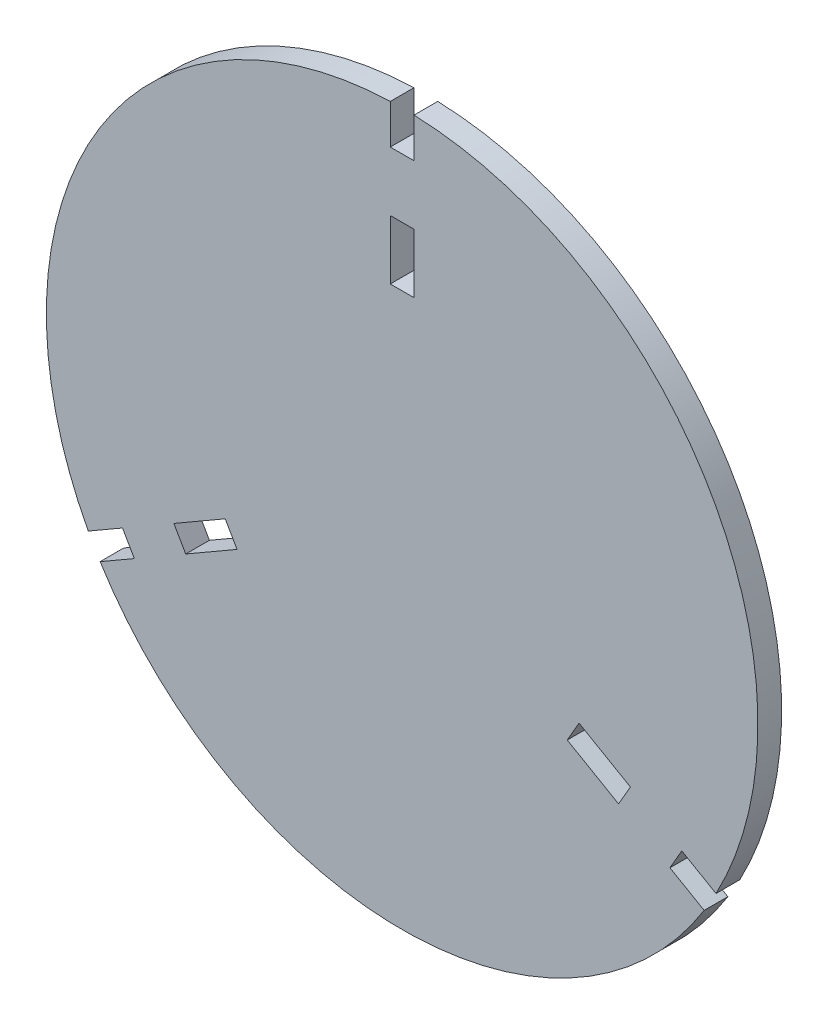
ISO-10303-21;
HEADER;
FILE_DESCRIPTION(('STEP AP214'),'2;1');
FILE_NAME('part.step','',(''),(''),'','','');
FILE_SCHEMA(('AUTOMOTIVE_DESIGN { 1 0 10303 214 1 1 1 1 }'));
ENDSEC;
DATA;
#1=APPLICATION_CONTEXT('core data for automotive mechanical design processes');
#2=APPLICATION_PROTOCOL_DEFINITION('international standard','automotive_design',2000,#1);
#3=PRODUCT_CONTEXT('',#1,'mechanical');
#4=PRODUCT('Part','Part','',(#3));
#5=PRODUCT_RELATED_PRODUCT_CATEGORY('part','',(#4));
#6=PRODUCT_DEFINITION_FORMATION('','',#4);
#7=PRODUCT_DEFINITION_CONTEXT('part definition',#1,'design');
#8=PRODUCT_DEFINITION('design','',#6,#7);
#9=PRODUCT_DEFINITION_SHAPE('','',#8);
#10=(LENGTH_UNIT() NAMED_UNIT(*) SI_UNIT(.MILLI.,.METRE.));
#11=(NAMED_UNIT(*) PLANE_ANGLE_UNIT() SI_UNIT($,.RADIAN.));
#12=(NAMED_UNIT(*) SI_UNIT($,.STERADIAN.) SOLID_ANGLE_UNIT());
#13=UNCERTAINTY_MEASURE_WITH_UNIT(LENGTH_MEASURE(1.E-05),#10,'distance_accuracy_value','');
#14=(GEOMETRIC_REPRESENTATION_CONTEXT(3) GLOBAL_UNCERTAINTY_ASSIGNED_CONTEXT((#13)) GLOBAL_UNIT_ASSIGNED_CONTEXT((#10,
#11,#12)) REPRESENTATION_CONTEXT('',''));
#15=CARTESIAN_POINT('',(0.,0.,0.));
#16=DIRECTION('',(0.,0.,1.));
#17=DIRECTION('',(1.,0.,0.));
#18=AXIS2_PLACEMENT_3D('',#15,#16,#17);
#19=CARTESIAN_POINT('',(0.,0.,12.));
#20=DIRECTION('',(0.,0.,1.));
#21=DIRECTION('',(1.,0.,0.));
#22=AXIS2_PLACEMENT_3D('',#19,#20,#21);
#23=PLANE('',#22);
#24=CARTESIAN_POINT('',(0.,0.,12.));
#25=DIRECTION('',(0.,0.,1.));
#26=DIRECTION('',(1.,0.,0.));
#27=AXIS2_PLACEMENT_3D('',#24,#25,#26);
#28=CIRCLE('',#27,180.);
#29=CARTESIAN_POINT('',(-6.,179.899972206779,12.));
#30=VERTEX_POINT('',#29);
#31=CARTESIAN_POINT('',(-158.797946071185,-84.7538336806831,12.));
#32=VERTEX_POINT('',#31);
#33=EDGE_CURVE('E341',#30,#32,#28,.T.);
#34=ORIENTED_EDGE('',*,*,#33,.T.);
#35=DIRECTION('',(0.866025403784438,0.500000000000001,0.));
#36=VECTOR('',#35,1.);
#37=CARTESIAN_POINT('',(-158.797946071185,-84.7538336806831,12.));
#38=LINE('',#37,#36);
#39=CARTESIAN_POINT('',(-141.477437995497,-74.7538336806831,12.));
#40=VERTEX_POINT('',#39);
#41=EDGE_CURVE('E345',#32,#40,#38,.T.);
#42=ORIENTED_EDGE('',*,*,#41,.T.);
#43=DIRECTION('',(0.500000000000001,-0.866025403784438,0.));
#44=VECTOR('',#43,1.);
#45=CARTESIAN_POINT('',(-135.477437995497,-85.1461385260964,12.));
#46=LINE('',#45,#44);
#47=CARTESIAN_POINT('',(-135.477437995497,-85.1461385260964,12.));
#48=VERTEX_POINT('',#47);
#49=EDGE_CURVE('E349',#40,#48,#46,.T.);
#50=ORIENTED_EDGE('',*,*,#49,.T.);
#51=DIRECTION('',(-0.866025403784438,-0.500000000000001,0.));
#52=VECTOR('',#51,1.);
#53=CARTESIAN_POINT('',(-152.797946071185,-95.1461385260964,12.));
#54=LINE('',#53,#52);
#55=CARTESIAN_POINT('',(-152.797946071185,-95.1461385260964,12.));
#56=VERTEX_POINT('',#55);
#57=EDGE_CURVE('E352',#48,#56,#54,.T.);
#58=ORIENTED_EDGE('',*,*,#57,.T.);
#59=CARTESIAN_POINT('',(0.,0.,12.));
#60=DIRECTION('',(0.,0.,1.));
#61=DIRECTION('',(1.,0.,0.));
#62=AXIS2_PLACEMENT_3D('',#59,#60,#61);
#63=CIRCLE('',#62,180.);
#64=CARTESIAN_POINT('',(152.797946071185,-95.1461385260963,12.));
#65=VERTEX_POINT('',#64);
#66=EDGE_CURVE('E355',#56,#65,#63,.T.);
#67=ORIENTED_EDGE('',*,*,#66,.T.);
#68=DIRECTION('',(-0.866025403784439,0.5,0.));
#69=VECTOR('',#68,1.);
#70=CARTESIAN_POINT('',(152.797946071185,-95.1461385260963,12.));
#71=LINE('',#70,#69);
#72=CARTESIAN_POINT('',(135.477437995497,-85.1461385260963,12.));
#73=VERTEX_POINT('',#72);
#74=EDGE_CURVE('E358',#65,#73,#71,.T.);
#75=ORIENTED_EDGE('',*,*,#74,.T.);
#76=DIRECTION('',(0.500000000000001,0.866025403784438,0.));
#77=VECTOR('',#76,1.);
#78=CARTESIAN_POINT('',(141.477437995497,-74.753833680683,12.));
#79=LINE('',#78,#77);
#80=CARTESIAN_POINT('',(141.477437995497,-74.753833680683,12.));
#81=VERTEX_POINT('',#80);
#82=EDGE_CURVE('E361',#73,#81,#79,.T.);
#83=ORIENTED_EDGE('',*,*,#82,.T.);
#84=DIRECTION('',(0.866025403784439,-0.5,0.));
#85=VECTOR('',#84,1.);
#86=CARTESIAN_POINT('',(158.797946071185,-84.753833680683,12.));
#87=LINE('',#86,#85);
#88=CARTESIAN_POINT('',(158.797946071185,-84.7538336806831,12.));
#89=VERTEX_POINT('',#88);
#90=EDGE_CURVE('E364',#81,#89,#87,.T.);
#91=ORIENTED_EDGE('',*,*,#90,.T.);
#92=CARTESIAN_POINT('',(0.,0.,12.));
#93=DIRECTION('',(0.,0.,1.));
#94=DIRECTION('',(1.,0.,0.));
#95=AXIS2_PLACEMENT_3D('',#92,#93,#94);
#96=CIRCLE('',#95,180.);
#97=CARTESIAN_POINT('',(6.,179.899972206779,12.));
#98=VERTEX_POINT('',#97);
#99=EDGE_CURVE('E367',#89,#98,#96,.T.);
#100=ORIENTED_EDGE('',*,*,#99,.T.);
#101=DIRECTION('',(0.,-1.,0.));
#102=VECTOR('',#101,1.);
#103=CARTESIAN_POINT('',(6.,179.899972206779,12.));
#104=LINE('',#103,#102);
#105=CARTESIAN_POINT('',(6.,159.899972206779,12.));
#106=VERTEX_POINT('',#105);
#107=EDGE_CURVE('E370',#98,#106,#104,.T.);
#108=ORIENTED_EDGE('',*,*,#107,.T.);
#109=DIRECTION('',(-1.,0.,0.));
#110=VECTOR('',#109,1.);
#111=CARTESIAN_POINT('',(-6.,159.899972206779,12.));
#112=LINE('',#111,#110);
#113=CARTESIAN_POINT('',(-6.,159.899972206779,12.));
#114=VERTEX_POINT('',#113);
#115=EDGE_CURVE('E373',#106,#114,#112,.T.);
#116=ORIENTED_EDGE('',*,*,#115,.T.);
#117=DIRECTION('',(0.,1.,0.));
#118=VECTOR('',#117,1.);
#119=CARTESIAN_POINT('',(-6.,179.899972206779,12.));
#120=LINE('',#119,#118);
#121=EDGE_CURVE('E376',#114,#30,#120,.T.);
#122=ORIENTED_EDGE('',*,*,#121,.T.);
#123=EDGE_LOOP('',(#34,#42,#50,#58,#67,#75,#83,#91,#100,#108,#116,#122));
#124=FACE_BOUND('',#123,.T.);
#125=DIRECTION('',(1.,0.,0.));
#126=VECTOR('',#125,1.);
#127=CARTESIAN_POINT('',(-6.,99.8999722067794,12.));
#128=LINE('',#127,#126);
#129=CARTESIAN_POINT('',(-6.,99.8999722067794,12.));
#130=VERTEX_POINT('',#129);
#131=CARTESIAN_POINT('',(6.,99.8999722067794,12.));
#132=VERTEX_POINT('',#131);
#133=EDGE_CURVE('E301',#130,#132,#128,.T.);
#134=ORIENTED_EDGE('',*,*,#133,.F.);
#135=DIRECTION('',(0.,-1.,0.));
#136=VECTOR('',#135,1.);
#137=CARTESIAN_POINT('',(-6.,129.899972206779,12.));
#138=LINE('',#137,#136);
#139=CARTESIAN_POINT('',(-6.,129.899972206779,12.));
#140=VERTEX_POINT('',#139);
#141=EDGE_CURVE('E298',#140,#130,#138,.T.);
#142=ORIENTED_EDGE('',*,*,#141,.F.);
#143=DIRECTION('',(-1.,0.,0.));
#144=VECTOR('',#143,1.);
#145=CARTESIAN_POINT('',(-6.,129.899972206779,12.));
#146=LINE('',#145,#144);
#147=CARTESIAN_POINT('',(6.,129.899972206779,12.));
#148=VERTEX_POINT('',#147);
#149=EDGE_CURVE('E309',#148,#140,#146,.T.);
#150=ORIENTED_EDGE('',*,*,#149,.F.);
#151=DIRECTION('',(0.,1.,0.));
#152=VECTOR('',#151,1.);
#153=CARTESIAN_POINT('',(6.,129.899972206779,12.));
#154=LINE('',#153,#152);
#155=EDGE_CURVE('E305',#132,#148,#154,.T.);
#156=ORIENTED_EDGE('',*,*,#155,.F.);
#157=EDGE_LOOP('',(#134,#142,#150,#156));
#158=FACE_BOUND('',#157,.T.);
#159=DIRECTION('',(-0.5,-0.866025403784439,0.));
#160=VECTOR('',#159,1.);
#161=CARTESIAN_POINT('',(89.5159137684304,-44.753833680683,12.));
#162=LINE('',#161,#160);
#163=CARTESIAN_POINT('',(89.5159137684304,-44.753833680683,12.));
#164=VERTEX_POINT('',#163);
#165=CARTESIAN_POINT('',(83.5159137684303,-55.1461385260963,12.));
#166=VERTEX_POINT('',#165);
#167=EDGE_CURVE('E258',#164,#166,#162,.T.);
#168=ORIENTED_EDGE('',*,*,#167,.F.);
#169=DIRECTION('',(-0.866025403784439,0.5,0.));
#170=VECTOR('',#169,1.);
#171=CARTESIAN_POINT('',(115.496675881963,-59.753833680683,12.));
#172=LINE('',#171,#170);
#173=CARTESIAN_POINT('',(115.496675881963,-59.753833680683,12.));
#174=VERTEX_POINT('',#173);
#175=EDGE_CURVE('E255',#174,#164,#172,.T.);
#176=ORIENTED_EDGE('',*,*,#175,.F.);
#177=DIRECTION('',(0.499999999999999,0.866025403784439,0.));
#178=VECTOR('',#177,1.);
#179=CARTESIAN_POINT('',(115.496675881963,-59.753833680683,12.));
#180=LINE('',#179,#178);
#181=CARTESIAN_POINT('',(109.496675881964,-70.1461385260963,12.));
#182=VERTEX_POINT('',#181);
#183=EDGE_CURVE('E266',#182,#174,#180,.T.);
#184=ORIENTED_EDGE('',*,*,#183,.F.);
#185=DIRECTION('',(0.866025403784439,-0.499999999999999,0.));
#186=VECTOR('',#185,1.);
#187=CARTESIAN_POINT('',(109.496675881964,-70.1461385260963,12.));
#188=LINE('',#187,#186);
#189=EDGE_CURVE('E262',#166,#182,#188,.T.);
#190=ORIENTED_EDGE('',*,*,#189,.F.);
#191=EDGE_LOOP('',(#168,#176,#184,#190));
#192=FACE_BOUND('',#191,.T.);
#193=DIRECTION('',(-0.5,0.866025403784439,0.));
#194=VECTOR('',#193,1.);
#195=CARTESIAN_POINT('',(-83.5159137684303,-55.1461385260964,12.));
#196=LINE('',#195,#194);
#197=CARTESIAN_POINT('',(-83.5159137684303,-55.1461385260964,12.));
#198=VERTEX_POINT('',#197);
#199=CARTESIAN_POINT('',(-89.5159137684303,-44.7538336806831,12.));
#200=VERTEX_POINT('',#199);
#201=EDGE_CURVE('E216',#198,#200,#196,.T.);
#202=ORIENTED_EDGE('',*,*,#201,.F.);
#203=DIRECTION('',(0.866025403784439,0.5,0.));
#204=VECTOR('',#203,1.);
#205=CARTESIAN_POINT('',(-109.496675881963,-70.1461385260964,12.));
#206=LINE('',#205,#204);
#207=CARTESIAN_POINT('',(-109.496675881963,-70.1461385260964,12.));
#208=VERTEX_POINT('',#207);
#209=EDGE_CURVE('E207',#208,#198,#206,.T.);
#210=ORIENTED_EDGE('',*,*,#209,.F.);
#211=DIRECTION('',(0.500000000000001,-0.866025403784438,0.));
#212=VECTOR('',#211,1.);
#213=CARTESIAN_POINT('',(-109.496675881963,-70.1461385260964,12.));
#214=LINE('',#213,#212);
#215=CARTESIAN_POINT('',(-115.496675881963,-59.7538336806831,12.));
#216=VERTEX_POINT('',#215);
#217=EDGE_CURVE('E233',#216,#208,#214,.T.);
#218=ORIENTED_EDGE('',*,*,#217,.F.);
#219=DIRECTION('',(-0.866025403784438,-0.5,0.));
#220=VECTOR('',#219,1.);
#221=CARTESIAN_POINT('',(-115.496675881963,-59.7538336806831,12.));
#222=LINE('',#221,#220);
#223=EDGE_CURVE('E229',#200,#216,#222,.T.);
#224=ORIENTED_EDGE('',*,*,#223,.F.);
#225=EDGE_LOOP('',(#202,#210,#218,#224));
#226=FACE_BOUND('',#225,.T.);
#227=ADVANCED_FACE('F45',(#124,#158,#192,#226),#23,.T.);
#228=CARTESIAN_POINT('',(0.,0.,0.));
#229=DIRECTION('',(0.,0.,1.));
#230=DIRECTION('',(1.,0.,0.));
#231=AXIS2_PLACEMENT_3D('',#228,#229,#230);
#232=PLANE('',#231);
#233=DIRECTION('',(-0.866025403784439,0.5,0.));
#234=VECTOR('',#233,1.);
#235=CARTESIAN_POINT('',(115.496675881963,-59.753833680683,0.));
#236=LINE('',#235,#234);
#237=CARTESIAN_POINT('',(115.496675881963,-59.753833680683,0.));
#238=VERTEX_POINT('',#237);
#239=CARTESIAN_POINT('',(89.5159137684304,-44.753833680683,0.));
#240=VERTEX_POINT('',#239);
#241=EDGE_CURVE('E225',#238,#240,#236,.T.);
#242=ORIENTED_EDGE('',*,*,#241,.T.);
#243=DIRECTION('',(-0.5,-0.866025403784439,0.));
#244=VECTOR('',#243,1.);
#245=CARTESIAN_POINT('',(89.5159137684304,-44.753833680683,0.));
#246=LINE('',#245,#244);
#247=CARTESIAN_POINT('',(83.5159137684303,-55.1461385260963,0.));
#248=VERTEX_POINT('',#247);
#249=EDGE_CURVE('E273',#240,#248,#246,.T.);
#250=ORIENTED_EDGE('',*,*,#249,.T.);
#251=DIRECTION('',(0.866025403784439,-0.499999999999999,0.));
#252=VECTOR('',#251,1.);
#253=CARTESIAN_POINT('',(109.496675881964,-70.1461385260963,0.));
#254=LINE('',#253,#252);
#255=CARTESIAN_POINT('',(109.496675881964,-70.1461385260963,0.));
#256=VERTEX_POINT('',#255);
#257=EDGE_CURVE('E277',#248,#256,#254,.T.);
#258=ORIENTED_EDGE('',*,*,#257,.T.);
#259=DIRECTION('',(0.499999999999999,0.866025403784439,0.));
#260=VECTOR('',#259,1.);
#261=CARTESIAN_POINT('',(115.496675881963,-59.753833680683,0.));
#262=LINE('',#261,#260);
#263=EDGE_CURVE('E259',#256,#238,#262,.T.);
#264=ORIENTED_EDGE('',*,*,#263,.T.);
#265=EDGE_LOOP('',(#242,#250,#258,#264));
#266=FACE_BOUND('',#265,.T.);
#267=CARTESIAN_POINT('',(0.,0.,0.));
#268=DIRECTION('',(0.,0.,1.));
#269=DIRECTION('',(1.,0.,0.));
#270=AXIS2_PLACEMENT_3D('',#267,#268,#269);
#271=CIRCLE('',#270,180.);
#272=CARTESIAN_POINT('',(-6.,179.899972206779,0.));
#273=VERTEX_POINT('',#272);
#274=CARTESIAN_POINT('',(-158.797946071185,-84.7538336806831,0.));
#275=VERTEX_POINT('',#274);
#276=EDGE_CURVE('E340',#273,#275,#271,.T.);
#277=ORIENTED_EDGE('',*,*,#276,.F.);
#278=DIRECTION('',(0.,1.,0.));
#279=VECTOR('',#278,1.);
#280=CARTESIAN_POINT('',(-6.,179.899972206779,0.));
#281=LINE('',#280,#279);
#282=CARTESIAN_POINT('',(-6.,159.899972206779,0.));
#283=VERTEX_POINT('',#282);
#284=EDGE_CURVE('E346',#283,#273,#281,.T.);
#285=ORIENTED_EDGE('',*,*,#284,.F.);
#286=DIRECTION('',(-1.,0.,0.));
#287=VECTOR('',#286,1.);
#288=CARTESIAN_POINT('',(-6.,159.899972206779,0.));
#289=LINE('',#288,#287);
#290=CARTESIAN_POINT('',(6.,159.899972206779,0.));
#291=VERTEX_POINT('',#290);
#292=EDGE_CURVE('E410',#291,#283,#289,.T.);
#293=ORIENTED_EDGE('',*,*,#292,.F.);
#294=DIRECTION('',(0.,-1.,0.));
#295=VECTOR('',#294,1.);
#296=CARTESIAN_POINT('',(6.,179.899972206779,0.));
#297=LINE('',#296,#295);
#298=CARTESIAN_POINT('',(6.,179.899972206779,0.));
#299=VERTEX_POINT('',#298);
#300=EDGE_CURVE('E407',#299,#291,#297,.T.);
#301=ORIENTED_EDGE('',*,*,#300,.F.);
#302=CARTESIAN_POINT('',(0.,0.,0.));
#303=DIRECTION('',(0.,0.,1.));
#304=DIRECTION('',(1.,0.,0.));
#305=AXIS2_PLACEMENT_3D('',#302,#303,#304);
#306=CIRCLE('',#305,180.);
#307=CARTESIAN_POINT('',(158.797946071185,-84.7538336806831,0.));
#308=VERTEX_POINT('',#307);
#309=EDGE_CURVE('E404',#308,#299,#306,.T.);
#310=ORIENTED_EDGE('',*,*,#309,.F.);
#311=DIRECTION('',(0.866025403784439,-0.5,0.));
#312=VECTOR('',#311,1.);
#313=CARTESIAN_POINT('',(158.797946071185,-84.753833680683,0.));
#314=LINE('',#313,#312);
#315=CARTESIAN_POINT('',(141.477437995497,-74.753833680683,0.));
#316=VERTEX_POINT('',#315);
#317=EDGE_CURVE('E401',#316,#308,#314,.T.);
#318=ORIENTED_EDGE('',*,*,#317,.F.);
#319=DIRECTION('',(0.500000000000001,0.866025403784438,0.));
#320=VECTOR('',#319,1.);
#321=CARTESIAN_POINT('',(141.477437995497,-74.753833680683,0.));
#322=LINE('',#321,#320);
#323=CARTESIAN_POINT('',(135.477437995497,-85.1461385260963,0.));
#324=VERTEX_POINT('',#323);
#325=EDGE_CURVE('E398',#324,#316,#322,.T.);
#326=ORIENTED_EDGE('',*,*,#325,.F.);
#327=DIRECTION('',(-0.866025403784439,0.5,0.));
#328=VECTOR('',#327,1.);
#329=CARTESIAN_POINT('',(152.797946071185,-95.1461385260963,0.));
#330=LINE('',#329,#328);
#331=CARTESIAN_POINT('',(152.797946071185,-95.1461385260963,0.));
#332=VERTEX_POINT('',#331);
#333=EDGE_CURVE('E395',#332,#324,#330,.T.);
#334=ORIENTED_EDGE('',*,*,#333,.F.);
#335=CARTESIAN_POINT('',(0.,0.,0.));
#336=DIRECTION('',(0.,0.,1.));
#337=DIRECTION('',(1.,0.,0.));
#338=AXIS2_PLACEMENT_3D('',#335,#336,#337);
#339=CIRCLE('',#338,180.);
#340=CARTESIAN_POINT('',(-152.797946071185,-95.1461385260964,0.));
#341=VERTEX_POINT('',#340);
#342=EDGE_CURVE('E392',#341,#332,#339,.T.);
#343=ORIENTED_EDGE('',*,*,#342,.F.);
#344=DIRECTION('',(-0.866025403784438,-0.500000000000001,0.));
#345=VECTOR('',#344,1.);
#346=CARTESIAN_POINT('',(-152.797946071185,-95.1461385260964,0.));
#347=LINE('',#346,#345);
#348=CARTESIAN_POINT('',(-135.477437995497,-85.1461385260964,0.));
#349=VERTEX_POINT('',#348);
#350=EDGE_CURVE('E389',#349,#341,#347,.T.);
#351=ORIENTED_EDGE('',*,*,#350,.F.);
#352=DIRECTION('',(0.500000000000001,-0.866025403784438,0.));
#353=VECTOR('',#352,1.);
#354=CARTESIAN_POINT('',(-135.477437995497,-85.1461385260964,0.));
#355=LINE('',#354,#353);
#356=CARTESIAN_POINT('',(-141.477437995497,-74.7538336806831,0.));
#357=VERTEX_POINT('',#356);
#358=EDGE_CURVE('E386',#357,#349,#355,.T.);
#359=ORIENTED_EDGE('',*,*,#358,.F.);
#360=DIRECTION('',(0.866025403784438,0.500000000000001,0.));
#361=VECTOR('',#360,1.);
#362=CARTESIAN_POINT('',(-158.797946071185,-84.7538336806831,0.));
#363=LINE('',#362,#361);
#364=EDGE_CURVE('E383',#275,#357,#363,.T.);
#365=ORIENTED_EDGE('',*,*,#364,.F.);
#366=EDGE_LOOP('',(#277,#285,#293,#301,#310,#318,#326,#334,#343,#351,#359,#365));
#367=FACE_BOUND('',#366,.T.);
#368=DIRECTION('',(0.,-1.,0.));
#369=VECTOR('',#368,1.);
#370=CARTESIAN_POINT('',(-6.,129.899972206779,0.));
#371=LINE('',#370,#369);
#372=CARTESIAN_POINT('',(-6.,129.899972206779,0.));
#373=VERTEX_POINT('',#372);
#374=CARTESIAN_POINT('',(-6.,99.8999722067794,0.));
#375=VERTEX_POINT('',#374);
#376=EDGE_CURVE('E297',#373,#375,#371,.T.);
#377=ORIENTED_EDGE('',*,*,#376,.T.);
#378=DIRECTION('',(1.,0.,0.));
#379=VECTOR('',#378,1.);
#380=CARTESIAN_POINT('',(-6.,99.8999722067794,0.));
#381=LINE('',#380,#379);
#382=CARTESIAN_POINT('',(6.,99.8999722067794,0.));
#383=VERTEX_POINT('',#382);
#384=EDGE_CURVE('E316',#375,#383,#381,.T.);
#385=ORIENTED_EDGE('',*,*,#384,.T.);
#386=DIRECTION('',(0.,1.,0.));
#387=VECTOR('',#386,1.);
#388=CARTESIAN_POINT('',(6.,129.899972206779,0.));
#389=LINE('',#388,#387);
#390=CARTESIAN_POINT('',(6.,129.899972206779,0.));
#391=VERTEX_POINT('',#390);
#392=EDGE_CURVE('E320',#383,#391,#389,.T.);
#393=ORIENTED_EDGE('',*,*,#392,.T.);
#394=DIRECTION('',(-1.,0.,0.));
#395=VECTOR('',#394,1.);
#396=CARTESIAN_POINT('',(-6.,129.899972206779,0.));
#397=LINE('',#396,#395);
#398=EDGE_CURVE('E302',#391,#373,#397,.T.);
#399=ORIENTED_EDGE('',*,*,#398,.T.);
#400=EDGE_LOOP('',(#377,#385,#393,#399));
#401=FACE_BOUND('',#400,.T.);
#402=DIRECTION('',(0.866025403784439,0.5,0.));
#403=VECTOR('',#402,1.);
#404=CARTESIAN_POINT('',(-109.496675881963,-70.1461385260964,0.));
#405=LINE('',#404,#403);
#406=CARTESIAN_POINT('',(-109.496675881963,-70.1461385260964,0.));
#407=VERTEX_POINT('',#406);
#408=CARTESIAN_POINT('',(-83.5159137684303,-55.1461385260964,0.));
#409=VERTEX_POINT('',#408);
#410=EDGE_CURVE('E69',#407,#409,#405,.T.);
#411=ORIENTED_EDGE('',*,*,#410,.T.);
#412=DIRECTION('',(-0.5,0.866025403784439,0.));
#413=VECTOR('',#412,1.);
#414=CARTESIAN_POINT('',(-83.5159137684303,-55.1461385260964,0.));
#415=LINE('',#414,#413);
#416=CARTESIAN_POINT('',(-89.5159137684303,-44.7538336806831,0.));
#417=VERTEX_POINT('',#416);
#418=EDGE_CURVE('E223',#409,#417,#415,.T.);
#419=ORIENTED_EDGE('',*,*,#418,.T.);
#420=DIRECTION('',(-0.866025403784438,-0.5,0.));
#421=VECTOR('',#420,1.);
#422=CARTESIAN_POINT('',(-115.496675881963,-59.7538336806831,0.));
#423=LINE('',#422,#421);
#424=CARTESIAN_POINT('',(-115.496675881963,-59.7538336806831,0.));
#425=VERTEX_POINT('',#424);
#426=EDGE_CURVE('E242',#417,#425,#423,.T.);
#427=ORIENTED_EDGE('',*,*,#426,.T.);
#428=DIRECTION('',(0.500000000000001,-0.866025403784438,0.));
#429=VECTOR('',#428,1.);
#430=CARTESIAN_POINT('',(-109.496675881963,-70.1461385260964,0.));
#431=LINE('',#430,#429);
#432=EDGE_CURVE('E217',#425,#407,#431,.T.);
#433=ORIENTED_EDGE('',*,*,#432,.T.);
#434=EDGE_LOOP('',(#411,#419,#427,#433));
#435=FACE_BOUND('',#434,.T.);
#436=ADVANCED_FACE('F465',(#266,#367,#401,#435),#232,.F.);
#437=CARTESIAN_POINT('',(0.,0.,12.));
#438=DIRECTION('',(0.,0.,-1.));
#439=DIRECTION('',(-1.,0.,0.));
#440=AXIS2_PLACEMENT_3D('',#437,#438,#439);
#441=CYLINDRICAL_SURFACE('',#440,180.);
#442=ORIENTED_EDGE('',*,*,#276,.T.);
#443=DIRECTION('',(0.,0.,-1.));
#444=VECTOR('',#443,1.);
#445=CARTESIAN_POINT('',(-158.797946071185,-84.7538336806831,12.));
#446=LINE('',#445,#444);
#447=EDGE_CURVE('E11',#32,#275,#446,.T.);
#448=ORIENTED_EDGE('',*,*,#447,.F.);
#449=ORIENTED_EDGE('',*,*,#33,.F.);
#450=DIRECTION('',(0.,0.,-1.));
#451=VECTOR('',#450,1.);
#452=CARTESIAN_POINT('',(-6.,179.899972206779,12.));
#453=LINE('',#452,#451);
#454=EDGE_CURVE('E379',#30,#273,#453,.T.);
#455=ORIENTED_EDGE('',*,*,#454,.T.);
#456=EDGE_LOOP('',(#442,#448,#449,#455));
#457=FACE_BOUND('',#456,.T.);
#458=ADVANCED_FACE('F47',(#457),#441,.T.);
#459=CARTESIAN_POINT('',(-158.797946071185,-84.7538336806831,12.));
#460=DIRECTION('',(-0.500000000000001,0.866025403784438,0.));
#461=DIRECTION('',(-0.866025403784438,-0.500000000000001,0.));
#462=AXIS2_PLACEMENT_3D('',#459,#460,#461);
#463=PLANE('',#462);
#464=ORIENTED_EDGE('',*,*,#364,.T.);
#465=DIRECTION('',(0.,0.,-1.));
#466=VECTOR('',#465,1.);
#467=CARTESIAN_POINT('',(-141.477437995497,-74.7538336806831,12.));
#468=LINE('',#467,#466);
#469=EDGE_CURVE('E54',#40,#357,#468,.T.);
#470=ORIENTED_EDGE('',*,*,#469,.F.);
#471=ORIENTED_EDGE('',*,*,#41,.F.);
#472=ORIENTED_EDGE('',*,*,#447,.T.);
#473=EDGE_LOOP('',(#464,#470,#471,#472));
#474=FACE_BOUND('',#473,.T.);
#475=ADVANCED_FACE('F483',(#474),#463,.F.);
#476=CARTESIAN_POINT('',(-135.477437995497,-85.1461385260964,12.));
#477=DIRECTION('',(0.866025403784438,0.500000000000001,0.));
#478=DIRECTION('',(-0.500000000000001,0.866025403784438,0.));
#479=AXIS2_PLACEMENT_3D('',#476,#477,#478);
#480=PLANE('',#479);
#481=ORIENTED_EDGE('',*,*,#358,.T.);
#482=DIRECTION('',(0.,0.,-1.));
#483=VECTOR('',#482,1.);
#484=CARTESIAN_POINT('',(-135.477437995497,-85.1461385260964,12.));
#485=LINE('',#484,#483);
#486=EDGE_CURVE('E450',#48,#349,#485,.T.);
#487=ORIENTED_EDGE('',*,*,#486,.F.);
#488=ORIENTED_EDGE('',*,*,#49,.F.);
#489=ORIENTED_EDGE('',*,*,#469,.T.);
#490=EDGE_LOOP('',(#481,#487,#488,#489));
#491=FACE_BOUND('',#490,.T.);
#492=ADVANCED_FACE('F459',(#491),#480,.F.);
#493=CARTESIAN_POINT('',(-152.797946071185,-95.1461385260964,12.));
#494=DIRECTION('',(0.500000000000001,-0.866025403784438,0.));
#495=DIRECTION('',(0.866025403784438,0.500000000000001,0.));
#496=AXIS2_PLACEMENT_3D('',#493,#494,#495);
#497=PLANE('',#496);
#498=ORIENTED_EDGE('',*,*,#350,.T.);
#499=DIRECTION('',(0.,0.,-1.));
#500=VECTOR('',#499,1.);
#501=CARTESIAN_POINT('',(-152.797946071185,-95.1461385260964,12.));
#502=LINE('',#501,#500);
#503=EDGE_CURVE('E446',#56,#341,#502,.T.);
#504=ORIENTED_EDGE('',*,*,#503,.F.);
#505=ORIENTED_EDGE('',*,*,#57,.F.);
#506=ORIENTED_EDGE('',*,*,#486,.T.);
#507=EDGE_LOOP('',(#498,#504,#505,#506));
#508=FACE_BOUND('',#507,.T.);
#509=ADVANCED_FACE('F471',(#508),#497,.F.);
#510=CARTESIAN_POINT('',(0.,0.,12.));
#511=DIRECTION('',(0.,0.,-1.));
#512=DIRECTION('',(-1.,0.,0.));
#513=AXIS2_PLACEMENT_3D('',#510,#511,#512);
#514=CYLINDRICAL_SURFACE('',#513,180.);
#515=ORIENTED_EDGE('',*,*,#342,.T.);
#516=DIRECTION('',(0.,0.,-1.));
#517=VECTOR('',#516,1.);
#518=CARTESIAN_POINT('',(152.797946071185,-95.1461385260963,12.));
#519=LINE('',#518,#517);
#520=EDGE_CURVE('E442',#65,#332,#519,.T.);
#521=ORIENTED_EDGE('',*,*,#520,.F.);
#522=ORIENTED_EDGE('',*,*,#66,.F.);
#523=ORIENTED_EDGE('',*,*,#503,.T.);
#524=EDGE_LOOP('',(#515,#521,#522,#523));
#525=FACE_BOUND('',#524,.T.);
#526=ADVANCED_FACE('F475',(#525),#514,.T.);
#527=CARTESIAN_POINT('',(152.797946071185,-95.1461385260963,12.));
#528=DIRECTION('',(-0.5,-0.866025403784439,0.));
#529=DIRECTION('',(0.866025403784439,-0.5,0.));
#530=AXIS2_PLACEMENT_3D('',#527,#528,#529);
#531=PLANE('',#530);
#532=ORIENTED_EDGE('',*,*,#333,.T.);
#533=DIRECTION('',(0.,0.,-1.));
#534=VECTOR('',#533,1.);
#535=CARTESIAN_POINT('',(135.477437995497,-85.1461385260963,12.));
#536=LINE('',#535,#534);
#537=EDGE_CURVE('E438',#73,#324,#536,.T.);
#538=ORIENTED_EDGE('',*,*,#537,.F.);
#539=ORIENTED_EDGE('',*,*,#74,.F.);
#540=ORIENTED_EDGE('',*,*,#520,.T.);
#541=EDGE_LOOP('',(#532,#538,#539,#540));
#542=FACE_BOUND('',#541,.T.);
#543=ADVANCED_FACE('F516',(#542),#531,.F.);
#544=CARTESIAN_POINT('',(141.477437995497,-74.753833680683,12.));
#545=DIRECTION('',(-0.866025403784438,0.500000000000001,0.));
#546=DIRECTION('',(-0.500000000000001,-0.866025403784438,0.));
#547=AXIS2_PLACEMENT_3D('',#544,#545,#546);
#548=PLANE('',#547);
#549=ORIENTED_EDGE('',*,*,#325,.T.);
#550=DIRECTION('',(0.,0.,-1.));
#551=VECTOR('',#550,1.);
#552=CARTESIAN_POINT('',(141.477437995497,-74.753833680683,12.));
#553=LINE('',#552,#551);
#554=EDGE_CURVE('E434',#81,#316,#553,.T.);
#555=ORIENTED_EDGE('',*,*,#554,.F.);
#556=ORIENTED_EDGE('',*,*,#82,.F.);
#557=ORIENTED_EDGE('',*,*,#537,.T.);
#558=EDGE_LOOP('',(#549,#555,#556,#557));
#559=FACE_BOUND('',#558,.T.);
#560=ADVANCED_FACE('F514',(#559),#548,.F.);
#561=CARTESIAN_POINT('',(158.797946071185,-84.753833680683,12.));
#562=DIRECTION('',(0.5,0.866025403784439,0.));
#563=DIRECTION('',(-0.866025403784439,0.5,0.));
#564=AXIS2_PLACEMENT_3D('',#561,#562,#563);
#565=PLANE('',#564);
#566=ORIENTED_EDGE('',*,*,#317,.T.);
#567=DIRECTION('',(0.,0.,-1.));
#568=VECTOR('',#567,1.);
#569=CARTESIAN_POINT('',(158.797946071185,-84.7538336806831,12.));
#570=LINE('',#569,#568);
#571=EDGE_CURVE('E430',#89,#308,#570,.T.);
#572=ORIENTED_EDGE('',*,*,#571,.F.);
#573=ORIENTED_EDGE('',*,*,#90,.F.);
#574=ORIENTED_EDGE('',*,*,#554,.T.);
#575=EDGE_LOOP('',(#566,#572,#573,#574));
#576=FACE_BOUND('',#575,.T.);
#577=ADVANCED_FACE('F510',(#576),#565,.F.);
#578=CARTESIAN_POINT('',(0.,0.,12.));
#579=DIRECTION('',(0.,0.,-1.));
#580=DIRECTION('',(-1.,0.,0.));
#581=AXIS2_PLACEMENT_3D('',#578,#579,#580);
#582=CYLINDRICAL_SURFACE('',#581,180.);
#583=ORIENTED_EDGE('',*,*,#309,.T.);
#584=DIRECTION('',(0.,0.,-1.));
#585=VECTOR('',#584,1.);
#586=CARTESIAN_POINT('',(6.,179.899972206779,12.));
#587=LINE('',#586,#585);
#588=EDGE_CURVE('E426',#98,#299,#587,.T.);
#589=ORIENTED_EDGE('',*,*,#588,.F.);
#590=ORIENTED_EDGE('',*,*,#99,.F.);
#591=ORIENTED_EDGE('',*,*,#571,.T.);
#592=EDGE_LOOP('',(#583,#589,#590,#591));
#593=FACE_BOUND('',#592,.T.);
#594=ADVANCED_FACE('F505',(#593),#582,.T.);
#595=CARTESIAN_POINT('',(6.,179.899972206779,12.));
#596=DIRECTION('',(1.,0.,0.));
#597=DIRECTION('',(0.,0.,-1.));
#598=AXIS2_PLACEMENT_3D('',#595,#596,#597);
#599=PLANE('',#598);
#600=ORIENTED_EDGE('',*,*,#300,.T.);
#601=DIRECTION('',(0.,0.,-1.));
#602=VECTOR('',#601,1.);
#603=CARTESIAN_POINT('',(6.,159.899972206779,12.));
#604=LINE('',#603,#602);
#605=EDGE_CURVE('E422',#106,#291,#604,.T.);
#606=ORIENTED_EDGE('',*,*,#605,.F.);
#607=ORIENTED_EDGE('',*,*,#107,.F.);
#608=ORIENTED_EDGE('',*,*,#588,.T.);
#609=EDGE_LOOP('',(#600,#606,#607,#608));
#610=FACE_BOUND('',#609,.T.);
#611=ADVANCED_FACE('F499',(#610),#599,.F.);
#612=CARTESIAN_POINT('',(-6.,159.899972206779,12.));
#613=DIRECTION('',(0.,-1.,0.));
#614=DIRECTION('',(0.,0.,-1.));
#615=AXIS2_PLACEMENT_3D('',#612,#613,#614);
#616=PLANE('',#615);
#617=ORIENTED_EDGE('',*,*,#292,.T.);
#618=DIRECTION('',(0.,0.,-1.));
#619=VECTOR('',#618,1.);
#620=CARTESIAN_POINT('',(-6.,159.899972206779,12.));
#621=LINE('',#620,#619);
#622=EDGE_CURVE('E418',#114,#283,#621,.T.);
#623=ORIENTED_EDGE('',*,*,#622,.F.);
#624=ORIENTED_EDGE('',*,*,#115,.F.);
#625=ORIENTED_EDGE('',*,*,#605,.T.);
#626=EDGE_LOOP('',(#617,#623,#624,#625));
#627=FACE_BOUND('',#626,.T.);
#628=ADVANCED_FACE('F495',(#627),#616,.F.);
#629=CARTESIAN_POINT('',(-6.,179.899972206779,12.));
#630=DIRECTION('',(-1.,0.,0.));
#631=DIRECTION('',(0.,0.,1.));
#632=AXIS2_PLACEMENT_3D('',#629,#630,#631);
#633=PLANE('',#632);
#634=ORIENTED_EDGE('',*,*,#284,.T.);
#635=ORIENTED_EDGE('',*,*,#454,.F.);
#636=ORIENTED_EDGE('',*,*,#121,.F.);
#637=ORIENTED_EDGE('',*,*,#622,.T.);
#638=EDGE_LOOP('',(#634,#635,#636,#637));
#639=FACE_BOUND('',#638,.T.);
#640=ADVANCED_FACE('F490',(#639),#633,.F.);
#641=CARTESIAN_POINT('',(-6.,129.899972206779,12.));
#642=DIRECTION('',(1.,0.,0.));
#643=DIRECTION('',(0.,1.,0.));
#644=AXIS2_PLACEMENT_3D('',#641,#642,#643);
#645=PLANE('',#644);
#646=ORIENTED_EDGE('',*,*,#376,.F.);
#647=DIRECTION('',(0.,0.,-1.));
#648=VECTOR('',#647,1.);
#649=CARTESIAN_POINT('',(-6.,129.899972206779,12.));
#650=LINE('',#649,#648);
#651=EDGE_CURVE('E312',#140,#373,#650,.T.);
#652=ORIENTED_EDGE('',*,*,#651,.F.);
#653=ORIENTED_EDGE('',*,*,#141,.T.);
#654=DIRECTION('',(0.,0.,-1.));
#655=VECTOR('',#654,1.);
#656=CARTESIAN_POINT('',(-6.,99.8999722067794,12.));
#657=LINE('',#656,#655);
#658=EDGE_CURVE('E336',#130,#375,#657,.T.);
#659=ORIENTED_EDGE('',*,*,#658,.T.);
#660=EDGE_LOOP('',(#646,#652,#653,#659));
#661=FACE_BOUND('',#660,.T.);
#662=ADVANCED_FACE('F533',(#661),#645,.T.);
#663=CARTESIAN_POINT('',(-6.,99.8999722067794,12.));
#664=DIRECTION('',(0.,1.,0.));
#665=DIRECTION('',(0.,0.,1.));
#666=AXIS2_PLACEMENT_3D('',#663,#664,#665);
#667=PLANE('',#666);
#668=ORIENTED_EDGE('',*,*,#384,.F.);
#669=ORIENTED_EDGE('',*,*,#658,.F.);
#670=ORIENTED_EDGE('',*,*,#133,.T.);
#671=DIRECTION('',(0.,0.,-1.));
#672=VECTOR('',#671,1.);
#673=CARTESIAN_POINT('',(6.,99.8999722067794,12.));
#674=LINE('',#673,#672);
#675=EDGE_CURVE('E333',#132,#383,#674,.T.);
#676=ORIENTED_EDGE('',*,*,#675,.T.);
#677=EDGE_LOOP('',(#668,#669,#670,#676));
#678=FACE_BOUND('',#677,.T.);
#679=ADVANCED_FACE('F576',(#678),#667,.T.);
#680=CARTESIAN_POINT('',(6.,129.899972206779,12.));
#681=DIRECTION('',(-1.,0.,0.));
#682=DIRECTION('',(0.,-1.,0.));
#683=AXIS2_PLACEMENT_3D('',#680,#681,#682);
#684=PLANE('',#683);
#685=ORIENTED_EDGE('',*,*,#392,.F.);
#686=ORIENTED_EDGE('',*,*,#675,.F.);
#687=ORIENTED_EDGE('',*,*,#155,.T.);
#688=DIRECTION('',(0.,0.,-1.));
#689=VECTOR('',#688,1.);
#690=CARTESIAN_POINT('',(6.,129.899972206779,12.));
#691=LINE('',#690,#689);
#692=EDGE_CURVE('E330',#148,#391,#691,.T.);
#693=ORIENTED_EDGE('',*,*,#692,.T.);
#694=EDGE_LOOP('',(#685,#686,#687,#693));
#695=FACE_BOUND('',#694,.T.);
#696=ADVANCED_FACE('F584',(#695),#684,.T.);
#697=CARTESIAN_POINT('',(-6.,129.899972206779,12.));
#698=DIRECTION('',(0.,-1.,0.));
#699=DIRECTION('',(0.,0.,-1.));
#700=AXIS2_PLACEMENT_3D('',#697,#698,#699);
#701=PLANE('',#700);
#702=ORIENTED_EDGE('',*,*,#398,.F.);
#703=ORIENTED_EDGE('',*,*,#692,.F.);
#704=ORIENTED_EDGE('',*,*,#149,.T.);
#705=ORIENTED_EDGE('',*,*,#651,.T.);
#706=EDGE_LOOP('',(#702,#703,#704,#705));
#707=FACE_BOUND('',#706,.T.);
#708=ADVANCED_FACE('F592',(#707),#701,.T.);
#709=CARTESIAN_POINT('',(115.496675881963,-59.753833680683,12.));
#710=DIRECTION('',(-0.5,-0.866025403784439,0.));
#711=DIRECTION('',(0.866025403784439,-0.5,0.));
#712=AXIS2_PLACEMENT_3D('',#709,#710,#711);
#713=PLANE('',#712);
#714=ORIENTED_EDGE('',*,*,#241,.F.);
#715=DIRECTION('',(0.,0.,-1.));
#716=VECTOR('',#715,1.);
#717=CARTESIAN_POINT('',(115.496675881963,-59.753833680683,12.));
#718=LINE('',#717,#716);
#719=EDGE_CURVE('E269',#174,#238,#718,.T.);
#720=ORIENTED_EDGE('',*,*,#719,.F.);
#721=ORIENTED_EDGE('',*,*,#175,.T.);
#722=DIRECTION('',(0.,0.,-1.));
#723=VECTOR('',#722,1.);
#724=CARTESIAN_POINT('',(89.5159137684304,-44.753833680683,12.));
#725=LINE('',#724,#723);
#726=EDGE_CURVE('E293',#164,#240,#725,.T.);
#727=ORIENTED_EDGE('',*,*,#726,.T.);
#728=EDGE_LOOP('',(#714,#720,#721,#727));
#729=FACE_BOUND('',#728,.T.);
#730=ADVANCED_FACE('F601',(#729),#713,.T.);
#731=CARTESIAN_POINT('',(89.5159137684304,-44.753833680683,12.));
#732=DIRECTION('',(0.866025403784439,-0.5,0.));
#733=DIRECTION('',(0.5,0.866025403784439,0.));
#734=AXIS2_PLACEMENT_3D('',#731,#732,#733);
#735=PLANE('',#734);
#736=ORIENTED_EDGE('',*,*,#249,.F.);
#737=ORIENTED_EDGE('',*,*,#726,.F.);
#738=ORIENTED_EDGE('',*,*,#167,.T.);
#739=DIRECTION('',(0.,0.,-1.));
#740=VECTOR('',#739,1.);
#741=CARTESIAN_POINT('',(83.5159137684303,-55.1461385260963,12.));
#742=LINE('',#741,#740);
#743=EDGE_CURVE('E290',#166,#248,#742,.T.);
#744=ORIENTED_EDGE('',*,*,#743,.T.);
#745=EDGE_LOOP('',(#736,#737,#738,#744));
#746=FACE_BOUND('',#745,.T.);
#747=ADVANCED_FACE('F610',(#746),#735,.T.);
#748=CARTESIAN_POINT('',(109.496675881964,-70.1461385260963,12.));
#749=DIRECTION('',(0.499999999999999,0.866025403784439,0.));
#750=DIRECTION('',(-0.866025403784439,0.499999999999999,0.));
#751=AXIS2_PLACEMENT_3D('',#748,#749,#750);
#752=PLANE('',#751);
#753=ORIENTED_EDGE('',*,*,#257,.F.);
#754=ORIENTED_EDGE('',*,*,#743,.F.);
#755=ORIENTED_EDGE('',*,*,#189,.T.);
#756=DIRECTION('',(0.,0.,-1.));
#757=VECTOR('',#756,1.);
#758=CARTESIAN_POINT('',(109.496675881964,-70.1461385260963,12.));
#759=LINE('',#758,#757);
#760=EDGE_CURVE('E287',#182,#256,#759,.T.);
#761=ORIENTED_EDGE('',*,*,#760,.T.);
#762=EDGE_LOOP('',(#753,#754,#755,#761));
#763=FACE_BOUND('',#762,.T.);
#764=ADVANCED_FACE('F619',(#763),#752,.T.);
#765=CARTESIAN_POINT('',(115.496675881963,-59.753833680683,12.));
#766=DIRECTION('',(-0.866025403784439,0.499999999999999,0.));
#767=DIRECTION('',(-0.499999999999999,-0.866025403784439,0.));
#768=AXIS2_PLACEMENT_3D('',#765,#766,#767);
#769=PLANE('',#768);
#770=ORIENTED_EDGE('',*,*,#263,.F.);
#771=ORIENTED_EDGE('',*,*,#760,.F.);
#772=ORIENTED_EDGE('',*,*,#183,.T.);
#773=ORIENTED_EDGE('',*,*,#719,.T.);
#774=EDGE_LOOP('',(#770,#771,#772,#773));
#775=FACE_BOUND('',#774,.T.);
#776=ADVANCED_FACE('F628',(#775),#769,.T.);
#777=CARTESIAN_POINT('',(-109.496675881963,-70.1461385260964,12.));
#778=DIRECTION('',(-0.5,0.866025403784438,0.));
#779=DIRECTION('',(-0.866025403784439,-0.5,0.));
#780=AXIS2_PLACEMENT_3D('',#777,#778,#779);
#781=PLANE('',#780);
#782=ORIENTED_EDGE('',*,*,#410,.F.);
#783=DIRECTION('',(0.,0.,-1.));
#784=VECTOR('',#783,1.);
#785=CARTESIAN_POINT('',(-109.496675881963,-70.1461385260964,12.));
#786=LINE('',#785,#784);
#787=EDGE_CURVE('E211',#208,#407,#786,.T.);
#788=ORIENTED_EDGE('',*,*,#787,.F.);
#789=ORIENTED_EDGE('',*,*,#209,.T.);
#790=DIRECTION('',(0.,0.,-1.));
#791=VECTOR('',#790,1.);
#792=CARTESIAN_POINT('',(-83.5159137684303,-55.1461385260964,12.));
#793=LINE('',#792,#791);
#794=EDGE_CURVE('E210',#198,#409,#793,.T.);
#795=ORIENTED_EDGE('',*,*,#794,.T.);
#796=EDGE_LOOP('',(#782,#788,#789,#795));
#797=FACE_BOUND('',#796,.T.);
#798=ADVANCED_FACE('F209',(#797),#781,.T.);
#799=CARTESIAN_POINT('',(-83.5159137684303,-55.1461385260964,12.));
#800=DIRECTION('',(-0.866025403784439,-0.5,0.));
#801=DIRECTION('',(0.5,-0.866025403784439,0.));
#802=AXIS2_PLACEMENT_3D('',#799,#800,#801);
#803=PLANE('',#802);
#804=ORIENTED_EDGE('',*,*,#418,.F.);
#805=ORIENTED_EDGE('',*,*,#794,.F.);
#806=ORIENTED_EDGE('',*,*,#201,.T.);
#807=DIRECTION('',(0.,0.,-1.));
#808=VECTOR('',#807,1.);
#809=CARTESIAN_POINT('',(-89.5159137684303,-44.7538336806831,12.));
#810=LINE('',#809,#808);
#811=EDGE_CURVE('E226',#200,#417,#810,.T.);
#812=ORIENTED_EDGE('',*,*,#811,.T.);
#813=EDGE_LOOP('',(#804,#805,#806,#812));
#814=FACE_BOUND('',#813,.T.);
#815=ADVANCED_FACE('F220',(#814),#803,.T.);
#816=CARTESIAN_POINT('',(-115.496675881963,-59.7538336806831,12.));
#817=DIRECTION('',(0.5,-0.866025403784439,0.));
#818=DIRECTION('',(0.866025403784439,0.5,0.));
#819=AXIS2_PLACEMENT_3D('',#816,#817,#818);
#820=PLANE('',#819);
#821=ORIENTED_EDGE('',*,*,#426,.F.);
#822=ORIENTED_EDGE('',*,*,#811,.F.);
#823=ORIENTED_EDGE('',*,*,#223,.T.);
#824=DIRECTION('',(0.,0.,-1.));
#825=VECTOR('',#824,1.);
#826=CARTESIAN_POINT('',(-115.496675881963,-59.7538336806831,12.));
#827=LINE('',#826,#825);
#828=EDGE_CURVE('E61',#216,#425,#827,.T.);
#829=ORIENTED_EDGE('',*,*,#828,.T.);
#830=EDGE_LOOP('',(#821,#822,#823,#829));
#831=FACE_BOUND('',#830,.T.);
#832=ADVANCED_FACE('F652',(#831),#820,.T.);
#833=CARTESIAN_POINT('',(-109.496675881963,-70.1461385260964,12.));
#834=DIRECTION('',(0.866025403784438,0.500000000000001,0.));
#835=DIRECTION('',(-0.500000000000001,0.866025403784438,0.));
#836=AXIS2_PLACEMENT_3D('',#833,#834,#835);
#837=PLANE('',#836);
#838=ORIENTED_EDGE('',*,*,#432,.F.);
#839=ORIENTED_EDGE('',*,*,#828,.F.);
#840=ORIENTED_EDGE('',*,*,#217,.T.);
#841=ORIENTED_EDGE('',*,*,#787,.T.);
#842=EDGE_LOOP('',(#838,#839,#840,#841));
#843=FACE_BOUND('',#842,.T.);
#844=ADVANCED_FACE('F660',(#843),#837,.T.);
#845=CLOSED_SHELL('',(#227,#436,#458,#475,#492,#509,#526,#543,#560,#577,#594,#611,#628,#640,
#662,#679,#696,#708,#730,#747,#764,#776,#798,#815,#832,#844));
#846=MANIFOLD_SOLID_BREP('B2',#845);
#847=ADVANCED_BREP_SHAPE_REPRESENTATION('',(#18,#846),#14);
#848=SHAPE_DEFINITION_REPRESENTATION(#9,#847);
ENDSEC;
END-ISO-10303-21;
